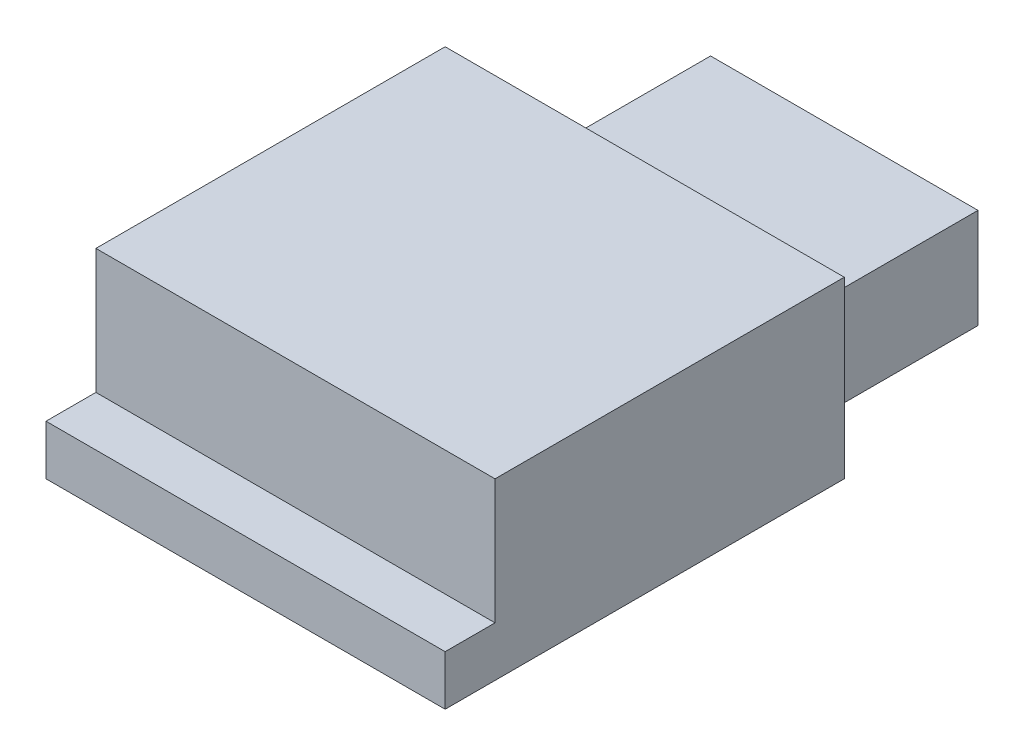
ISO-10303-21;
HEADER;
FILE_DESCRIPTION(('STEP AP214'),'2;1');
FILE_NAME('part.step','',(''),(''),'','','');
FILE_SCHEMA(('AUTOMOTIVE_DESIGN { 1 0 10303 214 1 1 1 1 }'));
ENDSEC;
DATA;
#1=APPLICATION_CONTEXT('core data for automotive mechanical design processes');
#2=APPLICATION_PROTOCOL_DEFINITION('international standard','automotive_design',2000,#1);
#3=PRODUCT_CONTEXT('',#1,'mechanical');
#4=PRODUCT('Part','Part','',(#3));
#5=PRODUCT_RELATED_PRODUCT_CATEGORY('part','',(#4));
#6=PRODUCT_DEFINITION_FORMATION('','',#4);
#7=PRODUCT_DEFINITION_CONTEXT('part definition',#1,'design');
#8=PRODUCT_DEFINITION('design','',#6,#7);
#9=PRODUCT_DEFINITION_SHAPE('','',#8);
#10=(LENGTH_UNIT() NAMED_UNIT(*) SI_UNIT(.MILLI.,.METRE.));
#11=(NAMED_UNIT(*) PLANE_ANGLE_UNIT() SI_UNIT($,.RADIAN.));
#12=(NAMED_UNIT(*) SI_UNIT($,.STERADIAN.) SOLID_ANGLE_UNIT());
#13=UNCERTAINTY_MEASURE_WITH_UNIT(LENGTH_MEASURE(1.E-05),#10,'distance_accuracy_value','');
#14=(GEOMETRIC_REPRESENTATION_CONTEXT(3) GLOBAL_UNCERTAINTY_ASSIGNED_CONTEXT((#13)) GLOBAL_UNIT_ASSIGNED_CONTEXT((#10,
#11,#12)) REPRESENTATION_CONTEXT('',''));
#15=CARTESIAN_POINT('',(0.,0.,0.));
#16=DIRECTION('',(0.,0.,1.));
#17=DIRECTION('',(1.,0.,0.));
#18=AXIS2_PLACEMENT_3D('',#15,#16,#17);
#19=CARTESIAN_POINT('',(0.,1.27,-10.16));
#20=DIRECTION('',(0.,0.,1.));
#21=DIRECTION('',(1.,0.,0.));
#22=AXIS2_PLACEMENT_3D('',#19,#20,#21);
#23=PLANE('',#22);
#24=DIRECTION('',(0.,-1.,0.));
#25=VECTOR('',#24,1.);
#26=CARTESIAN_POINT('',(8.4836,0.,-10.16));
#27=LINE('',#26,#25);
#28=CARTESIAN_POINT('',(8.4836,2.54,-10.16));
#29=VERTEX_POINT('',#28);
#30=CARTESIAN_POINT('',(8.4836,0.,-10.16));
#31=VERTEX_POINT('',#30);
#32=EDGE_CURVE('E34',#29,#31,#27,.T.);
#33=ORIENTED_EDGE('',*,*,#32,.F.);
#34=DIRECTION('',(1.,0.,0.));
#35=VECTOR('',#34,1.);
#36=CARTESIAN_POINT('',(8.4836,2.54,-10.16));
#37=LINE('',#36,#35);
#38=CARTESIAN_POINT('',(1.6764,2.54,-10.16));
#39=VERTEX_POINT('',#38);
#40=EDGE_CURVE('E105',#39,#29,#37,.T.);
#41=ORIENTED_EDGE('',*,*,#40,.F.);
#42=DIRECTION('',(0.,1.,0.));
#43=VECTOR('',#42,1.);
#44=CARTESIAN_POINT('',(1.6764,0.,-10.16));
#45=LINE('',#44,#43);
#46=CARTESIAN_POINT('',(1.6764,0.,-10.16));
#47=VERTEX_POINT('',#46);
#48=EDGE_CURVE('E53',#47,#39,#45,.T.);
#49=ORIENTED_EDGE('',*,*,#48,.F.);
#50=DIRECTION('',(-1.,0.,0.));
#51=VECTOR('',#50,1.);
#52=CARTESIAN_POINT('',(0.,0.,-10.16));
#53=LINE('',#52,#51);
#54=CARTESIAN_POINT('',(0.,0.,-10.16));
#55=VERTEX_POINT('',#54);
#56=EDGE_CURVE('E159',#47,#55,#53,.T.);
#57=ORIENTED_EDGE('',*,*,#56,.T.);
#58=DIRECTION('',(0.,-1.,0.));
#59=VECTOR('',#58,1.);
#60=CARTESIAN_POINT('',(0.,1.27,-10.16));
#61=LINE('',#60,#59);
#62=CARTESIAN_POINT('',(0.,4.445,-10.16));
#63=VERTEX_POINT('',#62);
#64=EDGE_CURVE('E175',#63,#55,#61,.T.);
#65=ORIENTED_EDGE('',*,*,#64,.F.);
#66=DIRECTION('',(-1.,0.,0.));
#67=VECTOR('',#66,1.);
#68=CARTESIAN_POINT('',(10.16,4.445,-10.16));
#69=LINE('',#68,#67);
#70=CARTESIAN_POINT('',(10.16,4.445,-10.16));
#71=VERTEX_POINT('',#70);
#72=EDGE_CURVE('E207',#71,#63,#69,.T.);
#73=ORIENTED_EDGE('',*,*,#72,.F.);
#74=DIRECTION('',(0.,-1.,0.));
#75=VECTOR('',#74,1.);
#76=CARTESIAN_POINT('',(10.16,1.27,-10.16));
#77=LINE('',#76,#75);
#78=CARTESIAN_POINT('',(10.16,0.,-10.16));
#79=VERTEX_POINT('',#78);
#80=EDGE_CURVE('E172',#71,#79,#77,.T.);
#81=ORIENTED_EDGE('',*,*,#80,.T.);
#82=EDGE_CURVE('E155',#79,#31,#53,.T.);
#83=ORIENTED_EDGE('',*,*,#82,.T.);
#84=EDGE_LOOP('',(#33,#41,#49,#57,#65,#73,#81,#83));
#85=FACE_BOUND('',#84,.T.);
#86=ADVANCED_FACE('F30',(#85),#23,.F.);
#87=CARTESIAN_POINT('',(0.,1.27,-10.16));
#88=DIRECTION('',(0.,-1.,0.));
#89=DIRECTION('',(0.,0.,-1.));
#90=AXIS2_PLACEMENT_3D('',#87,#88,#89);
#91=PLANE('',#90);
#92=DIRECTION('',(1.,0.,0.));
#93=VECTOR('',#92,1.);
#94=CARTESIAN_POINT('',(10.16,1.27,-1.27));
#95=LINE('',#94,#93);
#96=CARTESIAN_POINT('',(0.,1.27,-1.27));
#97=VERTEX_POINT('',#96);
#98=CARTESIAN_POINT('',(10.16,1.27,-1.27));
#99=VERTEX_POINT('',#98);
#100=EDGE_CURVE('E136',#97,#99,#95,.T.);
#101=ORIENTED_EDGE('',*,*,#100,.F.);
#102=DIRECTION('',(0.,0.,1.));
#103=VECTOR('',#102,1.);
#104=CARTESIAN_POINT('',(0.,1.27,0.));
#105=LINE('',#104,#103);
#106=CARTESIAN_POINT('',(0.,1.27,0.));
#107=VERTEX_POINT('',#106);
#108=EDGE_CURVE('E158',#97,#107,#105,.T.);
#109=ORIENTED_EDGE('',*,*,#108,.T.);
#110=DIRECTION('',(1.,0.,0.));
#111=VECTOR('',#110,1.);
#112=CARTESIAN_POINT('',(0.,1.27,0.));
#113=LINE('',#112,#111);
#114=CARTESIAN_POINT('',(10.16,1.27,0.));
#115=VERTEX_POINT('',#114);
#116=EDGE_CURVE('E168',#107,#115,#113,.T.);
#117=ORIENTED_EDGE('',*,*,#116,.T.);
#118=DIRECTION('',(0.,0.,-1.));
#119=VECTOR('',#118,1.);
#120=CARTESIAN_POINT('',(10.16,1.27,0.));
#121=LINE('',#120,#119);
#122=EDGE_CURVE('E140',#115,#99,#121,.T.);
#123=ORIENTED_EDGE('',*,*,#122,.T.);
#124=EDGE_LOOP('',(#101,#109,#117,#123));
#125=FACE_BOUND('',#124,.T.);
#126=ADVANCED_FACE('F186',(#125),#91,.F.);
#127=CARTESIAN_POINT('',(0.,1.27,0.));
#128=DIRECTION('',(1.,0.,0.));
#129=DIRECTION('',(0.,0.,-1.));
#130=AXIS2_PLACEMENT_3D('',#127,#128,#129);
#131=PLANE('',#130);
#132=DIRECTION('',(0.,0.,1.));
#133=VECTOR('',#132,1.);
#134=CARTESIAN_POINT('',(0.,0.,0.));
#135=LINE('',#134,#133);
#136=CARTESIAN_POINT('',(0.,0.,0.));
#137=VERTEX_POINT('',#136);
#138=EDGE_CURVE('E152',#55,#137,#135,.T.);
#139=ORIENTED_EDGE('',*,*,#138,.T.);
#140=DIRECTION('',(0.,-1.,0.));
#141=VECTOR('',#140,1.);
#142=CARTESIAN_POINT('',(0.,1.27,0.));
#143=LINE('',#142,#141);
#144=EDGE_CURVE('E11',#107,#137,#143,.T.);
#145=ORIENTED_EDGE('',*,*,#144,.F.);
#146=ORIENTED_EDGE('',*,*,#108,.F.);
#147=DIRECTION('',(0.,-1.,0.));
#148=VECTOR('',#147,1.);
#149=CARTESIAN_POINT('',(0.,4.445,-1.27));
#150=LINE('',#149,#148);
#151=CARTESIAN_POINT('',(0.,4.445,-1.27));
#152=VERTEX_POINT('',#151);
#153=EDGE_CURVE('E146',#152,#97,#150,.T.);
#154=ORIENTED_EDGE('',*,*,#153,.F.);
#155=DIRECTION('',(0.,0.,1.));
#156=VECTOR('',#155,1.);
#157=CARTESIAN_POINT('',(0.,4.445,-10.16));
#158=LINE('',#157,#156);
#159=EDGE_CURVE('E206',#63,#152,#158,.T.);
#160=ORIENTED_EDGE('',*,*,#159,.F.);
#161=ORIENTED_EDGE('',*,*,#64,.T.);
#162=EDGE_LOOP('',(#139,#145,#146,#154,#160,#161));
#163=FACE_BOUND('',#162,.T.);
#164=ADVANCED_FACE('F32',(#163),#131,.F.);
#165=CARTESIAN_POINT('',(0.,1.27,0.));
#166=DIRECTION('',(0.,0.,-1.));
#167=DIRECTION('',(-1.,0.,0.));
#168=AXIS2_PLACEMENT_3D('',#165,#166,#167);
#169=PLANE('',#168);
#170=DIRECTION('',(1.,0.,0.));
#171=VECTOR('',#170,1.);
#172=CARTESIAN_POINT('',(0.,0.,0.));
#173=LINE('',#172,#171);
#174=CARTESIAN_POINT('',(10.16,0.,0.));
#175=VERTEX_POINT('',#174);
#176=EDGE_CURVE('E191',#137,#175,#173,.T.);
#177=ORIENTED_EDGE('',*,*,#176,.T.);
#178=DIRECTION('',(0.,-1.,0.));
#179=VECTOR('',#178,1.);
#180=CARTESIAN_POINT('',(10.16,1.27,0.));
#181=LINE('',#180,#179);
#182=EDGE_CURVE('E40',#115,#175,#181,.T.);
#183=ORIENTED_EDGE('',*,*,#182,.F.);
#184=ORIENTED_EDGE('',*,*,#116,.F.);
#185=ORIENTED_EDGE('',*,*,#144,.T.);
#186=EDGE_LOOP('',(#177,#183,#184,#185));
#187=FACE_BOUND('',#186,.T.);
#188=ADVANCED_FACE('F190',(#187),#169,.F.);
#189=CARTESIAN_POINT('',(10.16,1.27,0.));
#190=DIRECTION('',(-1.,0.,0.));
#191=DIRECTION('',(0.,0.,1.));
#192=AXIS2_PLACEMENT_3D('',#189,#190,#191);
#193=PLANE('',#192);
#194=DIRECTION('',(0.,0.,-1.));
#195=VECTOR('',#194,1.);
#196=CARTESIAN_POINT('',(10.16,0.,0.));
#197=LINE('',#196,#195);
#198=EDGE_CURVE('E163',#175,#79,#197,.T.);
#199=ORIENTED_EDGE('',*,*,#198,.T.);
#200=ORIENTED_EDGE('',*,*,#80,.F.);
#201=DIRECTION('',(0.,0.,-1.));
#202=VECTOR('',#201,1.);
#203=CARTESIAN_POINT('',(10.16,4.445,-10.16));
#204=LINE('',#203,#202);
#205=CARTESIAN_POINT('',(10.16,4.445,-1.27));
#206=VERTEX_POINT('',#205);
#207=EDGE_CURVE('E133',#206,#71,#204,.T.);
#208=ORIENTED_EDGE('',*,*,#207,.F.);
#209=DIRECTION('',(0.,-1.,0.));
#210=VECTOR('',#209,1.);
#211=CARTESIAN_POINT('',(10.16,4.445,-1.27));
#212=LINE('',#211,#210);
#213=EDGE_CURVE('E143',#206,#99,#212,.T.);
#214=ORIENTED_EDGE('',*,*,#213,.T.);
#215=ORIENTED_EDGE('',*,*,#122,.F.);
#216=ORIENTED_EDGE('',*,*,#182,.T.);
#217=EDGE_LOOP('',(#199,#200,#208,#214,#215,#216));
#218=FACE_BOUND('',#217,.T.);
#219=ADVANCED_FACE('F194',(#218),#193,.F.);
#220=CARTESIAN_POINT('',(0.,0.,-10.16));
#221=DIRECTION('',(0.,-1.,0.));
#222=DIRECTION('',(0.,0.,-1.));
#223=AXIS2_PLACEMENT_3D('',#220,#221,#222);
#224=PLANE('',#223);
#225=ORIENTED_EDGE('',*,*,#138,.F.);
#226=ORIENTED_EDGE('',*,*,#56,.F.);
#227=DIRECTION('',(0.,0.,1.));
#228=VECTOR('',#227,1.);
#229=CARTESIAN_POINT('',(1.6764,0.,-15.24));
#230=LINE('',#229,#228);
#231=CARTESIAN_POINT('',(1.6764,0.,-15.24));
#232=VERTEX_POINT('',#231);
#233=EDGE_CURVE('E120',#232,#47,#230,.T.);
#234=ORIENTED_EDGE('',*,*,#233,.F.);
#235=DIRECTION('',(-1.,0.,0.));
#236=VECTOR('',#235,1.);
#237=CARTESIAN_POINT('',(8.4836,0.,-15.24));
#238=LINE('',#237,#236);
#239=CARTESIAN_POINT('',(8.4836,0.,-15.24));
#240=VERTEX_POINT('',#239);
#241=EDGE_CURVE('E309',#240,#232,#238,.T.);
#242=ORIENTED_EDGE('',*,*,#241,.F.);
#243=DIRECTION('',(0.,0.,1.));
#244=VECTOR('',#243,1.);
#245=CARTESIAN_POINT('',(8.4836,0.,-15.24));
#246=LINE('',#245,#244);
#247=EDGE_CURVE('E126',#240,#31,#246,.T.);
#248=ORIENTED_EDGE('',*,*,#247,.T.);
#249=ORIENTED_EDGE('',*,*,#82,.F.);
#250=ORIENTED_EDGE('',*,*,#198,.F.);
#251=ORIENTED_EDGE('',*,*,#176,.F.);
#252=EDGE_LOOP('',(#225,#226,#234,#242,#248,#249,#250,#251));
#253=FACE_BOUND('',#252,.T.);
#254=ADVANCED_FACE('F221',(#253),#224,.T.);
#255=CARTESIAN_POINT('',(10.16,4.445,-1.27));
#256=DIRECTION('',(0.,0.,-1.));
#257=DIRECTION('',(-1.,0.,0.));
#258=AXIS2_PLACEMENT_3D('',#255,#256,#257);
#259=PLANE('',#258);
#260=ORIENTED_EDGE('',*,*,#100,.T.);
#261=ORIENTED_EDGE('',*,*,#213,.F.);
#262=DIRECTION('',(1.,0.,0.));
#263=VECTOR('',#262,1.);
#264=CARTESIAN_POINT('',(10.16,4.445,-1.27));
#265=LINE('',#264,#263);
#266=EDGE_CURVE('E147',#152,#206,#265,.T.);
#267=ORIENTED_EDGE('',*,*,#266,.F.);
#268=ORIENTED_EDGE('',*,*,#153,.T.);
#269=EDGE_LOOP('',(#260,#261,#267,#268));
#270=FACE_BOUND('',#269,.T.);
#271=ADVANCED_FACE('F200',(#270),#259,.F.);
#272=CARTESIAN_POINT('',(10.16,4.445,-1.27));
#273=DIRECTION('',(0.,-1.,0.));
#274=DIRECTION('',(0.,0.,-1.));
#275=AXIS2_PLACEMENT_3D('',#272,#273,#274);
#276=PLANE('',#275);
#277=ORIENTED_EDGE('',*,*,#207,.T.);
#278=ORIENTED_EDGE('',*,*,#72,.T.);
#279=ORIENTED_EDGE('',*,*,#159,.T.);
#280=ORIENTED_EDGE('',*,*,#266,.T.);
#281=EDGE_LOOP('',(#277,#278,#279,#280));
#282=FACE_BOUND('',#281,.T.);
#283=ADVANCED_FACE('F211',(#282),#276,.F.);
#284=CARTESIAN_POINT('',(8.4836,0.,-15.24));
#285=DIRECTION('',(-1.,0.,0.));
#286=DIRECTION('',(0.,0.,1.));
#287=AXIS2_PLACEMENT_3D('',#284,#285,#286);
#288=PLANE('',#287);
#289=ORIENTED_EDGE('',*,*,#32,.T.);
#290=ORIENTED_EDGE('',*,*,#247,.F.);
#291=DIRECTION('',(0.,-1.,0.));
#292=VECTOR('',#291,1.);
#293=CARTESIAN_POINT('',(8.4836,0.,-15.24));
#294=LINE('',#293,#292);
#295=CARTESIAN_POINT('',(8.4836,2.54,-15.24));
#296=VERTEX_POINT('',#295);
#297=EDGE_CURVE('E110',#296,#240,#294,.T.);
#298=ORIENTED_EDGE('',*,*,#297,.F.);
#299=DIRECTION('',(0.,0.,1.));
#300=VECTOR('',#299,1.);
#301=CARTESIAN_POINT('',(8.4836,2.54,-15.24));
#302=LINE('',#301,#300);
#303=EDGE_CURVE('E124',#296,#29,#302,.T.);
#304=ORIENTED_EDGE('',*,*,#303,.T.);
#305=EDGE_LOOP('',(#289,#290,#298,#304));
#306=FACE_BOUND('',#305,.T.);
#307=ADVANCED_FACE('F213',(#306),#288,.F.);
#308=CARTESIAN_POINT('',(1.6764,0.,-15.24));
#309=DIRECTION('',(1.,0.,0.));
#310=DIRECTION('',(0.,0.,-1.));
#311=AXIS2_PLACEMENT_3D('',#308,#309,#310);
#312=PLANE('',#311);
#313=ORIENTED_EDGE('',*,*,#48,.T.);
#314=DIRECTION('',(0.,0.,1.));
#315=VECTOR('',#314,1.);
#316=CARTESIAN_POINT('',(1.6764,2.54,-15.24));
#317=LINE('',#316,#315);
#318=CARTESIAN_POINT('',(1.6764,2.54,-15.24));
#319=VERTEX_POINT('',#318);
#320=EDGE_CURVE('E117',#319,#39,#317,.T.);
#321=ORIENTED_EDGE('',*,*,#320,.F.);
#322=DIRECTION('',(0.,1.,0.));
#323=VECTOR('',#322,1.);
#324=CARTESIAN_POINT('',(1.6764,0.,-15.24));
#325=LINE('',#324,#323);
#326=EDGE_CURVE('E319',#232,#319,#325,.T.);
#327=ORIENTED_EDGE('',*,*,#326,.F.);
#328=ORIENTED_EDGE('',*,*,#233,.T.);
#329=EDGE_LOOP('',(#313,#321,#327,#328));
#330=FACE_BOUND('',#329,.T.);
#331=ADVANCED_FACE('F115',(#330),#312,.F.);
#332=CARTESIAN_POINT('',(8.4836,2.54,-15.24));
#333=DIRECTION('',(0.,-1.,0.));
#334=DIRECTION('',(0.,0.,-1.));
#335=AXIS2_PLACEMENT_3D('',#332,#333,#334);
#336=PLANE('',#335);
#337=ORIENTED_EDGE('',*,*,#40,.T.);
#338=ORIENTED_EDGE('',*,*,#303,.F.);
#339=DIRECTION('',(1.,0.,0.));
#340=VECTOR('',#339,1.);
#341=CARTESIAN_POINT('',(8.4836,2.54,-15.24));
#342=LINE('',#341,#340);
#343=EDGE_CURVE('E123',#319,#296,#342,.T.);
#344=ORIENTED_EDGE('',*,*,#343,.F.);
#345=ORIENTED_EDGE('',*,*,#320,.T.);
#346=EDGE_LOOP('',(#337,#338,#344,#345));
#347=FACE_BOUND('',#346,.T.);
#348=ADVANCED_FACE('F122',(#347),#336,.F.);
#349=CARTESIAN_POINT('',(8.4836,2.54,-15.24));
#350=DIRECTION('',(0.,0.,1.));
#351=DIRECTION('',(1.,0.,0.));
#352=AXIS2_PLACEMENT_3D('',#349,#350,#351);
#353=PLANE('',#352);
#354=ORIENTED_EDGE('',*,*,#297,.T.);
#355=ORIENTED_EDGE('',*,*,#241,.T.);
#356=ORIENTED_EDGE('',*,*,#326,.T.);
#357=ORIENTED_EDGE('',*,*,#343,.T.);
#358=EDGE_LOOP('',(#354,#355,#356,#357));
#359=FACE_BOUND('',#358,.T.);
#360=ADVANCED_FACE('F292',(#359),#353,.F.);
#361=CLOSED_SHELL('',(#86,#126,#164,#188,#219,#254,#271,#283,#307,#331,#348,#360));
#362=MANIFOLD_SOLID_BREP('B2',#361);
#363=ADVANCED_BREP_SHAPE_REPRESENTATION('',(#18,#362),#14);
#364=SHAPE_DEFINITION_REPRESENTATION(#9,#363);
ENDSEC;
END-ISO-10303-21;
